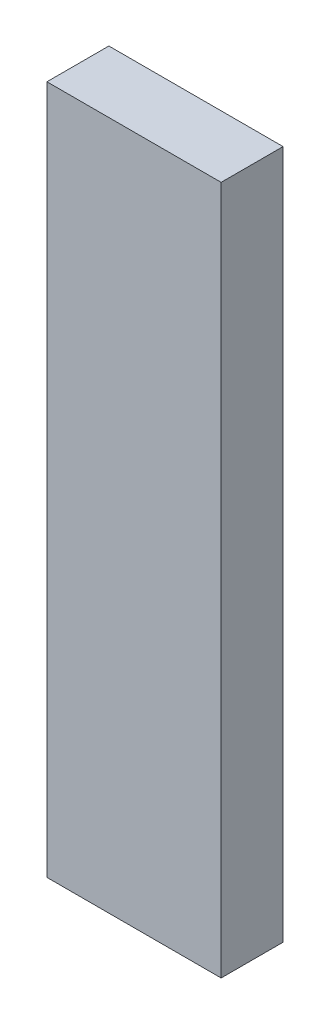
from build123d import *

# Parameters (mm, degrees)
ESQUISSE1_W      = 22.5
ESQUISSE1_H      = 89
EXTRUSION1_DEPTH = 8


with BuildPart() as part:
    # Esquisse1 → Extrusion1 (new body)
    with BuildSketch(Plane.XY):
        with Locations((11.25, 44.5)):
            Rectangle(ESQUISSE1_W, ESQUISSE1_H)
    extrude(amount=EXTRUSION1_DEPTH)


solid = part.part
